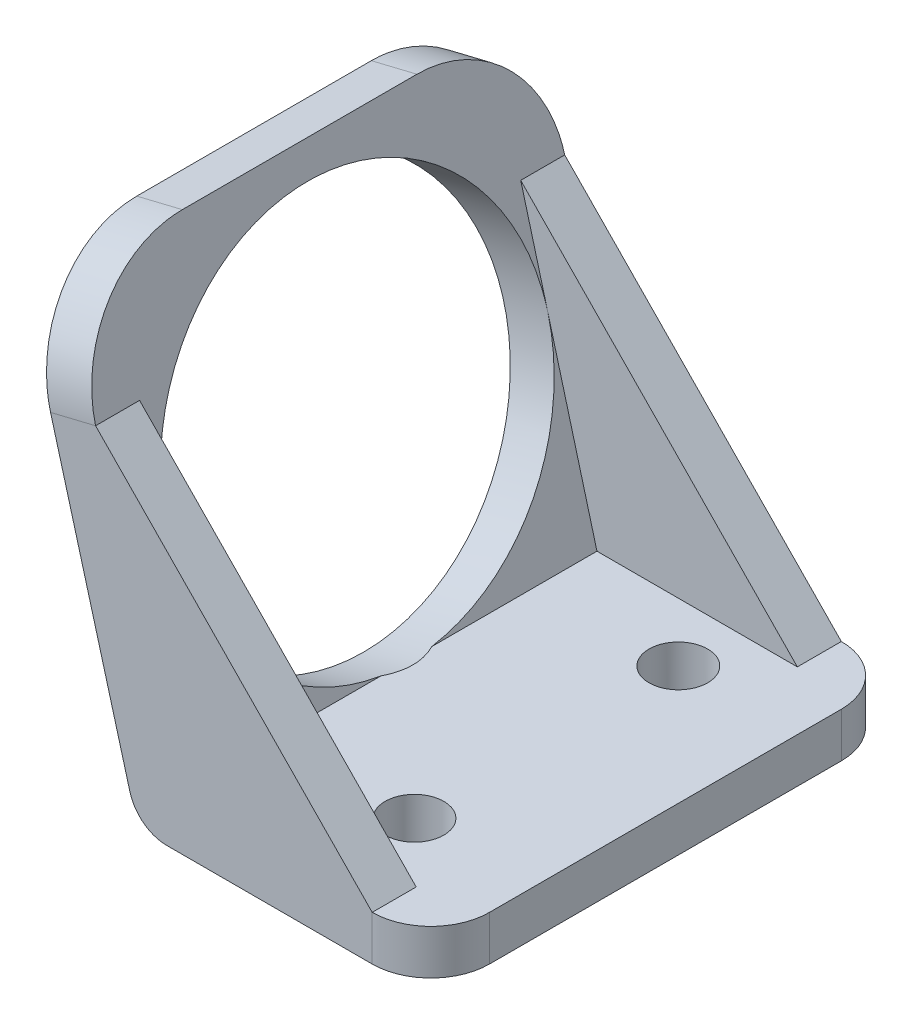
ISO-10303-21;
HEADER;
FILE_DESCRIPTION(('STEP AP214'),'2;1');
FILE_NAME('part.step','',(''),(''),'','','');
FILE_SCHEMA(('AUTOMOTIVE_DESIGN { 1 0 10303 214 1 1 1 1 }'));
ENDSEC;
DATA;
#1=APPLICATION_CONTEXT('core data for automotive mechanical design processes');
#2=APPLICATION_PROTOCOL_DEFINITION('international standard','automotive_design',2000,#1);
#3=PRODUCT_CONTEXT('',#1,'mechanical');
#4=PRODUCT('Part','Part','',(#3));
#5=PRODUCT_RELATED_PRODUCT_CATEGORY('part','',(#4));
#6=PRODUCT_DEFINITION_FORMATION('','',#4);
#7=PRODUCT_DEFINITION_CONTEXT('part definition',#1,'design');
#8=PRODUCT_DEFINITION('design','',#6,#7);
#9=PRODUCT_DEFINITION_SHAPE('','',#8);
#10=(LENGTH_UNIT() NAMED_UNIT(*) SI_UNIT(.MILLI.,.METRE.));
#11=(NAMED_UNIT(*) PLANE_ANGLE_UNIT() SI_UNIT($,.RADIAN.));
#12=(NAMED_UNIT(*) SI_UNIT($,.STERADIAN.) SOLID_ANGLE_UNIT());
#13=UNCERTAINTY_MEASURE_WITH_UNIT(LENGTH_MEASURE(1.E-05),#10,'distance_accuracy_value','');
#14=(GEOMETRIC_REPRESENTATION_CONTEXT(3) GLOBAL_UNCERTAINTY_ASSIGNED_CONTEXT((#13)) GLOBAL_UNIT_ASSIGNED_CONTEXT((#10,
#11,#12)) REPRESENTATION_CONTEXT('',''));
#15=CARTESIAN_POINT('',(0.,0.,0.));
#16=DIRECTION('',(0.,0.,1.));
#17=DIRECTION('',(1.,0.,0.));
#18=AXIS2_PLACEMENT_3D('',#15,#16,#17);
#19=CARTESIAN_POINT('',(-9.9792191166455,15.0455270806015,16.));
#20=DIRECTION('',(-0.965598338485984,-0.260038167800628,0.));
#21=DIRECTION('',(0.260038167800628,-0.965598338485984,0.));
#22=AXIS2_PLACEMENT_3D('',#19,#20,#21);
#23=PLANE('',#22);
#24=DIRECTION('',(-0.260038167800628,0.965598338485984,0.));
#25=VECTOR('',#24,1.);
#26=CARTESIAN_POINT('',(-9.9792191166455,15.0455270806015,14.5));
#27=LINE('',#26,#25);
#28=CARTESIAN_POINT('',(-6.3386847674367,1.52715034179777,14.5));
#29=VERTEX_POINT('',#28);
#30=CARTESIAN_POINT('',(-8.0138583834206,7.74756357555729,14.5));
#31=VERTEX_POINT('',#30);
#32=EDGE_CURVE('E323',#29,#31,#27,.T.);
#33=ORIENTED_EDGE('',*,*,#32,.F.);
#34=DIRECTION('',(0.,0.,-1.));
#35=VECTOR('',#34,1.);
#36=CARTESIAN_POINT('',(-6.3386847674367,1.52715034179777,16.));
#37=LINE('',#36,#35);
#38=CARTESIAN_POINT('',(-6.3386847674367,1.52715034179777,8.86678700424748));
#39=VERTEX_POINT('',#38);
#40=EDGE_CURVE('E230',#29,#39,#37,.T.);
#41=ORIENTED_EDGE('',*,*,#40,.T.);
#42=CARTESIAN_POINT('',(-8.0138583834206,7.74756357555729,8.));
#43=DIRECTION('',(-0.965598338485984,-0.260038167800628,0.));
#44=DIRECTION('',(0.260038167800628,-0.965598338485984,0.));
#45=AXIS2_PLACEMENT_3D('',#42,#43,#44);
#46=ELLIPSE('',#45,6.50008357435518,6.5);
#47=EDGE_CURVE('E239',#39,#31,#46,.T.);
#48=ORIENTED_EDGE('',*,*,#47,.T.);
#49=EDGE_LOOP('',(#33,#41,#48));
#50=FACE_BOUND('',#49,.T.);
#51=ADVANCED_FACE('F37',(#50),#23,.F.);
#52=DIRECTION('',(0.260038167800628,-0.965598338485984,0.));
#53=VECTOR('',#52,1.);
#54=CARTESIAN_POINT('',(-9.9792191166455,15.0455270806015,1.5));
#55=LINE('',#54,#53);
#56=CARTESIAN_POINT('',(-8.0138583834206,7.74756357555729,1.5));
#57=VERTEX_POINT('',#56);
#58=CARTESIAN_POINT('',(-6.3386847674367,1.52715034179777,1.5));
#59=VERTEX_POINT('',#58);
#60=EDGE_CURVE('E291',#57,#59,#55,.T.);
#61=ORIENTED_EDGE('',*,*,#60,.F.);
#62=CARTESIAN_POINT('',(-6.3386847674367,1.52715034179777,7.13321299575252));
#63=VERTEX_POINT('',#62);
#64=EDGE_CURVE('E238',#57,#63,#46,.T.);
#65=ORIENTED_EDGE('',*,*,#64,.T.);
#66=EDGE_CURVE('E201',#63,#59,#37,.T.);
#67=ORIENTED_EDGE('',*,*,#66,.T.);
#68=EDGE_LOOP('',(#61,#65,#67));
#69=FACE_BOUND('',#68,.T.);
#70=ADVANCED_FACE('F313',(#69),#23,.F.);
#71=CARTESIAN_POINT('',(-7.50402425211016,0.,16.));
#72=DIRECTION('',(0.964267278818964,0.264931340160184,0.));
#73=DIRECTION('',(-0.264931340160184,0.964267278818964,0.));
#74=AXIS2_PLACEMENT_3D('',#71,#72,#73);
#75=PLANE('',#74);
#76=CARTESIAN_POINT('',(-10.4738491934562,10.8092346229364,12.));
#77=DIRECTION('',(0.964267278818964,0.264931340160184,0.));
#78=DIRECTION('',(0.264931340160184,-0.964267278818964,0.));
#79=AXIS2_PLACEMENT_3D('',#76,#77,#78);
#80=ELLIPSE('',#79,4.00179521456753,4.);
#81=CARTESIAN_POINT('',(-10.4738491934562,10.8092346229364,16.));
#82=VERTEX_POINT('',#81);
#83=CARTESIAN_POINT('',(-11.5340501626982,14.6680348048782,12.));
#84=VERTEX_POINT('',#83);
#85=EDGE_CURVE('E176',#82,#84,#80,.F.);
#86=ORIENTED_EDGE('',*,*,#85,.T.);
#87=DIRECTION('',(0.,0.,-1.));
#88=VECTOR('',#87,1.);
#89=CARTESIAN_POINT('',(-11.5340501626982,14.6680348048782,16.));
#90=LINE('',#89,#88);
#91=CARTESIAN_POINT('',(-11.5340501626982,14.6680348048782,4.));
#92=VERTEX_POINT('',#91);
#93=EDGE_CURVE('E202',#84,#92,#90,.T.);
#94=ORIENTED_EDGE('',*,*,#93,.T.);
#95=CARTESIAN_POINT('',(-10.4738491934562,10.8092346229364,4.));
#96=DIRECTION('',(0.964267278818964,0.264931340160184,0.));
#97=DIRECTION('',(-0.264931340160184,0.964267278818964,0.));
#98=AXIS2_PLACEMENT_3D('',#95,#96,#97);
#99=ELLIPSE('',#98,4.00179521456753,4.);
#100=CARTESIAN_POINT('',(-10.4738491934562,10.8092346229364,0.));
#101=VERTEX_POINT('',#100);
#102=EDGE_CURVE('E177',#92,#101,#99,.F.);
#103=ORIENTED_EDGE('',*,*,#102,.T.);
#104=DIRECTION('',(0.264931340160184,-0.964267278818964,0.));
#105=VECTOR('',#104,1.);
#106=CARTESIAN_POINT('',(-7.50402425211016,0.,0.));
#107=LINE('',#106,#105);
#108=CARTESIAN_POINT('',(-7.76657131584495,0.955589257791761,0.));
#109=VERTEX_POINT('',#108);
#110=EDGE_CURVE('E208',#101,#109,#107,.T.);
#111=ORIENTED_EDGE('',*,*,#110,.T.);
#112=DIRECTION('',(0.,0.,-1.));
#113=VECTOR('',#112,1.);
#114=CARTESIAN_POINT('',(-7.76657131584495,0.955589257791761,16.));
#115=LINE('',#114,#113);
#116=CARTESIAN_POINT('',(-7.76657131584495,0.955589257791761,16.));
#117=VERTEX_POINT('',#116);
#118=EDGE_CURVE('E181',#109,#117,#115,.F.);
#119=ORIENTED_EDGE('',*,*,#118,.T.);
#120=DIRECTION('',(0.264931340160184,-0.964267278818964,0.));
#121=VECTOR('',#120,1.);
#122=CARTESIAN_POINT('',(-7.50402425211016,0.,16.));
#123=LINE('',#122,#121);
#124=EDGE_CURVE('E220',#82,#117,#123,.T.);
#125=ORIENTED_EDGE('',*,*,#124,.F.);
#126=EDGE_LOOP('',(#86,#94,#103,#111,#119,#125));
#127=FACE_BOUND('',#126,.T.);
#128=CARTESIAN_POINT('',(-9.51903720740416,7.33401740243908,8.));
#129=DIRECTION('',(-0.964267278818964,-0.264931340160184,0.));
#130=DIRECTION('',(0.264931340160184,-0.964267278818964,0.));
#131=AXIS2_PLACEMENT_3D('',#128,#129,#130);
#132=CIRCLE('',#131,6.5);
#133=CARTESIAN_POINT('',(-7.79698349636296,1.06628009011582,8.));
#134=VERTEX_POINT('',#133);
#135=EDGE_CURVE('E223',#134,#134,#132,.T.);
#136=ORIENTED_EDGE('',*,*,#135,.F.);
#137=EDGE_LOOP('',(#136));
#138=FACE_BOUND('',#137,.T.);
#139=ADVANCED_FACE('F206',(#127,#138),#75,.F.);
#140=CARTESIAN_POINT('',(-7.50402425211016,0.,16.));
#141=DIRECTION('',(0.,1.,0.));
#142=DIRECTION('',(0.,0.,1.));
#143=AXIS2_PLACEMENT_3D('',#140,#141,#142);
#144=PLANE('',#143);
#145=CARTESIAN_POINT('',(-1.56291912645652,0.,3.49999999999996));
#146=DIRECTION('',(0.,1.,0.));
#147=DIRECTION('',(0.,0.,1.));
#148=AXIS2_PLACEMENT_3D('',#145,#146,#147);
#149=CIRCLE('',#148,1.);
#150=CARTESIAN_POINT('',(-1.56291912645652,0.,4.49999999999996));
#151=VERTEX_POINT('',#150);
#152=EDGE_CURVE('E335',#151,#151,#149,.T.);
#153=ORIENTED_EDGE('',*,*,#152,.T.);
#154=EDGE_LOOP('',(#153));
#155=FACE_BOUND('',#154,.T.);
#156=CARTESIAN_POINT('',(-1.56291912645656,0.,12.5));
#157=DIRECTION('',(0.,1.,0.));
#158=DIRECTION('',(0.,0.,1.));
#159=AXIS2_PLACEMENT_3D('',#156,#157,#158);
#160=CIRCLE('',#159,1.);
#161=CARTESIAN_POINT('',(-1.56291912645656,0.,13.5));
#162=VERTEX_POINT('',#161);
#163=EDGE_CURVE('E328',#162,#162,#160,.T.);
#164=ORIENTED_EDGE('',*,*,#163,.T.);
#165=EDGE_LOOP('',(#164));
#166=FACE_BOUND('',#165,.T.);
#167=CARTESIAN_POINT('',(0.495975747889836,0.,14.));
#168=DIRECTION('',(0.,1.,0.));
#169=DIRECTION('',(0.,0.,1.));
#170=AXIS2_PLACEMENT_3D('',#167,#168,#169);
#171=CIRCLE('',#170,2.);
#172=CARTESIAN_POINT('',(2.49597574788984,0.,14.));
#173=VERTEX_POINT('',#172);
#174=CARTESIAN_POINT('',(0.495975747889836,0.,16.));
#175=VERTEX_POINT('',#174);
#176=EDGE_CURVE('E255',#173,#175,#171,.F.);
#177=ORIENTED_EDGE('',*,*,#176,.T.);
#178=DIRECTION('',(1.,0.,0.));
#179=VECTOR('',#178,1.);
#180=CARTESIAN_POINT('',(-7.50402425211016,0.,16.));
#181=LINE('',#180,#179);
#182=CARTESIAN_POINT('',(-6.51302385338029,0.,16.));
#183=VERTEX_POINT('',#182);
#184=EDGE_CURVE('E226',#183,#175,#181,.T.);
#185=ORIENTED_EDGE('',*,*,#184,.F.);
#186=DIRECTION('',(0.,0.,-1.));
#187=VECTOR('',#186,1.);
#188=CARTESIAN_POINT('',(-6.51302385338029,0.,16.));
#189=LINE('',#188,#187);
#190=CARTESIAN_POINT('',(-6.51302385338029,0.,0.));
#191=VERTEX_POINT('',#190);
#192=EDGE_CURVE('E260',#183,#191,#189,.T.);
#193=ORIENTED_EDGE('',*,*,#192,.T.);
#194=DIRECTION('',(1.,0.,0.));
#195=VECTOR('',#194,1.);
#196=CARTESIAN_POINT('',(-7.50402425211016,0.,0.));
#197=LINE('',#196,#195);
#198=CARTESIAN_POINT('',(0.495975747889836,0.,0.));
#199=VERTEX_POINT('',#198);
#200=EDGE_CURVE('E217',#191,#199,#197,.T.);
#201=ORIENTED_EDGE('',*,*,#200,.T.);
#202=CARTESIAN_POINT('',(0.495975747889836,0.,2.));
#203=DIRECTION('',(0.,1.,0.));
#204=DIRECTION('',(0.,0.,1.));
#205=AXIS2_PLACEMENT_3D('',#202,#203,#204);
#206=CIRCLE('',#205,2.);
#207=CARTESIAN_POINT('',(2.49597574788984,0.,2.));
#208=VERTEX_POINT('',#207);
#209=EDGE_CURVE('E257',#199,#208,#206,.F.);
#210=ORIENTED_EDGE('',*,*,#209,.T.);
#211=DIRECTION('',(0.,0.,-1.));
#212=VECTOR('',#211,1.);
#213=CARTESIAN_POINT('',(2.49597574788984,0.,16.));
#214=LINE('',#213,#212);
#215=EDGE_CURVE('E235',#173,#208,#214,.T.);
#216=ORIENTED_EDGE('',*,*,#215,.F.);
#217=EDGE_LOOP('',(#177,#185,#193,#201,#210,#216));
#218=FACE_BOUND('',#217,.T.);
#219=ADVANCED_FACE('F268',(#155,#166,#218),#144,.F.);
#220=CARTESIAN_POINT('',(2.49597574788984,0.,16.));
#221=DIRECTION('',(-1.,0.,0.));
#222=DIRECTION('',(0.,-1.,0.));
#223=AXIS2_PLACEMENT_3D('',#220,#221,#222);
#224=PLANE('',#223);
#225=ORIENTED_EDGE('',*,*,#215,.T.);
#226=DIRECTION('',(0.,1.,0.));
#227=VECTOR('',#226,1.);
#228=CARTESIAN_POINT('',(2.49597574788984,0.,2.));
#229=LINE('',#228,#227);
#230=CARTESIAN_POINT('',(2.49597574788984,1.52715034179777,2.));
#231=VERTEX_POINT('',#230);
#232=EDGE_CURVE('E245',#208,#231,#229,.T.);
#233=ORIENTED_EDGE('',*,*,#232,.T.);
#234=DIRECTION('',(0.,0.,-1.));
#235=VECTOR('',#234,1.);
#236=CARTESIAN_POINT('',(2.49597574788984,1.52715034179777,16.));
#237=LINE('',#236,#235);
#238=CARTESIAN_POINT('',(2.49597574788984,1.52715034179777,14.));
#239=VERTEX_POINT('',#238);
#240=EDGE_CURVE('E232',#239,#231,#237,.T.);
#241=ORIENTED_EDGE('',*,*,#240,.F.);
#242=DIRECTION('',(0.,1.,0.));
#243=VECTOR('',#242,1.);
#244=CARTESIAN_POINT('',(2.49597574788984,0.,14.));
#245=LINE('',#244,#243);
#246=EDGE_CURVE('E242',#239,#173,#245,.F.);
#247=ORIENTED_EDGE('',*,*,#246,.T.);
#248=EDGE_LOOP('',(#225,#233,#241,#247));
#249=FACE_BOUND('',#248,.T.);
#250=ADVANCED_FACE('F279',(#249),#224,.F.);
#251=CARTESIAN_POINT('',(-6.3386847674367,1.52715034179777,16.));
#252=DIRECTION('',(0.,-1.,0.));
#253=DIRECTION('',(0.,0.,-1.));
#254=AXIS2_PLACEMENT_3D('',#251,#252,#253);
#255=PLANE('',#254);
#256=CARTESIAN_POINT('',(-1.56291912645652,1.52715034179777,3.49999999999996));
#257=DIRECTION('',(0.,1.,0.));
#258=DIRECTION('',(0.,0.,-1.));
#259=AXIS2_PLACEMENT_3D('',#256,#257,#258);
#260=CIRCLE('',#259,1.);
#261=CARTESIAN_POINT('',(-1.56291912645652,1.52715034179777,2.49999999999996));
#262=VERTEX_POINT('',#261);
#263=EDGE_CURVE('E338',#262,#262,#260,.T.);
#264=ORIENTED_EDGE('',*,*,#263,.F.);
#265=EDGE_LOOP('',(#264));
#266=FACE_BOUND('',#265,.T.);
#267=CARTESIAN_POINT('',(-1.56291912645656,1.52715034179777,12.5));
#268=DIRECTION('',(0.,1.,0.));
#269=DIRECTION('',(0.,0.,1.));
#270=AXIS2_PLACEMENT_3D('',#267,#268,#269);
#271=CIRCLE('',#270,1.);
#272=CARTESIAN_POINT('',(-1.56291912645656,1.52715034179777,13.5));
#273=VERTEX_POINT('',#272);
#274=EDGE_CURVE('E332',#273,#273,#271,.T.);
#275=ORIENTED_EDGE('',*,*,#274,.F.);
#276=EDGE_LOOP('',(#275));
#277=FACE_BOUND('',#276,.T.);
#278=DIRECTION('',(-1.,0.,0.));
#279=VECTOR('',#278,1.);
#280=CARTESIAN_POINT('',(-6.3386847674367,1.52715034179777,14.5));
#281=LINE('',#280,#279);
#282=CARTESIAN_POINT('',(0.495975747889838,1.52715034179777,14.5));
#283=VERTEX_POINT('',#282);
#284=EDGE_CURVE('E295',#283,#29,#281,.T.);
#285=ORIENTED_EDGE('',*,*,#284,.F.);
#286=DIRECTION('',(0.,0.,-1.));
#287=VECTOR('',#286,1.);
#288=CARTESIAN_POINT('',(0.495975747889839,1.52715034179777,16.));
#289=LINE('',#288,#287);
#290=CARTESIAN_POINT('',(0.495975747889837,1.52715034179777,16.));
#291=VERTEX_POINT('',#290);
#292=EDGE_CURVE('E153',#283,#291,#289,.F.);
#293=ORIENTED_EDGE('',*,*,#292,.T.);
#294=CARTESIAN_POINT('',(0.495975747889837,1.52715034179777,14.));
#295=DIRECTION('',(0.,-1.,0.));
#296=DIRECTION('',(0.,0.,-1.));
#297=AXIS2_PLACEMENT_3D('',#294,#295,#296);
#298=CIRCLE('',#297,2.);
#299=EDGE_CURVE('E248',#291,#239,#298,.F.);
#300=ORIENTED_EDGE('',*,*,#299,.T.);
#301=ORIENTED_EDGE('',*,*,#240,.T.);
#302=CARTESIAN_POINT('',(0.495975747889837,1.52715034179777,2.));
#303=DIRECTION('',(0.,-1.,0.));
#304=DIRECTION('',(0.,0.,-1.));
#305=AXIS2_PLACEMENT_3D('',#302,#303,#304);
#306=CIRCLE('',#305,2.);
#307=CARTESIAN_POINT('',(0.495975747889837,1.52715034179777,0.));
#308=VERTEX_POINT('',#307);
#309=EDGE_CURVE('E250',#231,#308,#306,.F.);
#310=ORIENTED_EDGE('',*,*,#309,.T.);
#311=DIRECTION('',(0.,0.,1.));
#312=VECTOR('',#311,1.);
#313=CARTESIAN_POINT('',(0.495975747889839,1.52715034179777,16.));
#314=LINE('',#313,#312);
#315=CARTESIAN_POINT('',(0.495975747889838,1.52715034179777,1.5));
#316=VERTEX_POINT('',#315);
#317=EDGE_CURVE('E52',#308,#316,#314,.T.);
#318=ORIENTED_EDGE('',*,*,#317,.T.);
#319=DIRECTION('',(1.,0.,0.));
#320=VECTOR('',#319,1.);
#321=CARTESIAN_POINT('',(-6.3386847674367,1.52715034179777,1.5));
#322=LINE('',#321,#320);
#323=EDGE_CURVE('E302',#59,#316,#322,.T.);
#324=ORIENTED_EDGE('',*,*,#323,.F.);
#325=ORIENTED_EDGE('',*,*,#66,.F.);
#326=CARTESIAN_POINT('',(-30.6542184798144,1.52715034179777,8.));
#327=DIRECTION('',(0.,-1.,0.));
#328=DIRECTION('',(-1.,0.,0.));
#329=AXIS2_PLACEMENT_3D('',#326,#327,#328);
#330=ELLIPSE('',#329,24.5346586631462,6.5);
#331=EDGE_CURVE('E218',#63,#39,#330,.T.);
#332=ORIENTED_EDGE('',*,*,#331,.T.);
#333=ORIENTED_EDGE('',*,*,#40,.F.);
#334=EDGE_LOOP('',(#285,#293,#300,#301,#310,#318,#324,#325,#332,#333));
#335=FACE_BOUND('',#334,.T.);
#336=ADVANCED_FACE('F277',(#266,#277,#335),#255,.F.);
#337=CARTESIAN_POINT('',(-8.93874433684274,11.1819376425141,12.));
#338=DIRECTION('',(-0.965598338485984,-0.260038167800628,0.));
#339=DIRECTION('',(0.260038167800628,-0.965598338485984,0.));
#340=AXIS2_PLACEMENT_3D('',#337,#338,#339);
#341=ELLIPSE('',#340,4.0012386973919,4.);
#342=CARTESIAN_POINT('',(-9.9792191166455,15.0455270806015,12.));
#343=VERTEX_POINT('',#342);
#344=CARTESIAN_POINT('',(-8.93874433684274,11.1819376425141,16.));
#345=VERTEX_POINT('',#344);
#346=EDGE_CURVE('E45',#343,#345,#341,.F.);
#347=ORIENTED_EDGE('',*,*,#346,.T.);
#348=DIRECTION('',(0.,0.,1.));
#349=VECTOR('',#348,1.);
#350=CARTESIAN_POINT('',(-8.93874433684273,11.1819376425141,16.));
#351=LINE('',#350,#349);
#352=CARTESIAN_POINT('',(-8.93874433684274,11.1819376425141,14.5));
#353=VERTEX_POINT('',#352);
#354=EDGE_CURVE('E144',#345,#353,#351,.F.);
#355=ORIENTED_EDGE('',*,*,#354,.T.);
#356=EDGE_CURVE('E325',#31,#353,#27,.T.);
#357=ORIENTED_EDGE('',*,*,#356,.F.);
#358=EDGE_CURVE('E243',#31,#57,#46,.T.);
#359=ORIENTED_EDGE('',*,*,#358,.T.);
#360=CARTESIAN_POINT('',(-8.93874433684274,11.1819376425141,1.5));
#361=VERTEX_POINT('',#360);
#362=EDGE_CURVE('E60',#361,#57,#55,.T.);
#363=ORIENTED_EDGE('',*,*,#362,.F.);
#364=DIRECTION('',(0.,0.,-1.));
#365=VECTOR('',#364,1.);
#366=CARTESIAN_POINT('',(-8.93874433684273,11.1819376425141,16.));
#367=LINE('',#366,#365);
#368=CARTESIAN_POINT('',(-8.93874433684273,11.1819376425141,0.));
#369=VERTEX_POINT('',#368);
#370=EDGE_CURVE('E192',#361,#369,#367,.T.);
#371=ORIENTED_EDGE('',*,*,#370,.T.);
#372=CARTESIAN_POINT('',(-8.93874433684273,11.1819376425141,4.));
#373=DIRECTION('',(-0.965598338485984,-0.260038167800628,0.));
#374=DIRECTION('',(-0.260038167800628,0.965598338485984,0.));
#375=AXIS2_PLACEMENT_3D('',#372,#373,#374);
#376=ELLIPSE('',#375,4.0012386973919,4.);
#377=CARTESIAN_POINT('',(-9.9792191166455,15.0455270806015,4.));
#378=VERTEX_POINT('',#377);
#379=EDGE_CURVE('E174',#369,#378,#376,.F.);
#380=ORIENTED_EDGE('',*,*,#379,.T.);
#381=DIRECTION('',(0.,0.,-1.));
#382=VECTOR('',#381,1.);
#383=CARTESIAN_POINT('',(-9.9792191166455,15.0455270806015,16.));
#384=LINE('',#383,#382);
#385=EDGE_CURVE('E171',#343,#378,#384,.T.);
#386=ORIENTED_EDGE('',*,*,#385,.F.);
#387=EDGE_LOOP('',(#347,#355,#357,#359,#363,#371,#380,#386));
#388=FACE_BOUND('',#387,.T.);
#389=ADVANCED_FACE('F169',(#388),#23,.F.);
#390=CARTESIAN_POINT('',(-9.9792191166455,15.0455270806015,16.));
#391=DIRECTION('',(0.23593267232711,-0.971769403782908,0.));
#392=DIRECTION('',(0.971769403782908,0.23593267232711,0.));
#393=AXIS2_PLACEMENT_3D('',#390,#391,#392);
#394=PLANE('',#393);
#395=ORIENTED_EDGE('',*,*,#93,.F.);
#396=DIRECTION('',(-0.971769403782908,-0.23593267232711,0.));
#397=VECTOR('',#396,1.);
#398=CARTESIAN_POINT('',(-9.9792191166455,15.0455270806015,12.));
#399=LINE('',#398,#397);
#400=EDGE_CURVE('E189',#84,#343,#399,.F.);
#401=ORIENTED_EDGE('',*,*,#400,.T.);
#402=ORIENTED_EDGE('',*,*,#385,.T.);
#403=DIRECTION('',(-0.971769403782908,-0.23593267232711,0.));
#404=VECTOR('',#403,1.);
#405=CARTESIAN_POINT('',(-9.9792191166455,15.0455270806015,4.));
#406=LINE('',#405,#404);
#407=EDGE_CURVE('E186',#378,#92,#406,.T.);
#408=ORIENTED_EDGE('',*,*,#407,.T.);
#409=EDGE_LOOP('',(#395,#401,#402,#408));
#410=FACE_BOUND('',#409,.T.);
#411=ADVANCED_FACE('F199',(#410),#394,.F.);
#412=CARTESIAN_POINT('',(0.,0.,16.));
#413=DIRECTION('',(0.,0.,1.));
#414=DIRECTION('',(1.,0.,0.));
#415=AXIS2_PLACEMENT_3D('',#412,#413,#414);
#416=PLANE('',#415);
#417=DIRECTION('',(0.698908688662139,-0.715210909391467,0.));
#418=VECTOR('',#417,1.);
#419=CARTESIAN_POINT('',(-8.93874433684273,11.1819376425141,16.));
#420=LINE('',#419,#418);
#421=EDGE_CURVE('E147',#345,#291,#420,.T.);
#422=ORIENTED_EDGE('',*,*,#421,.F.);
#423=DIRECTION('',(-0.971769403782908,-0.23593267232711,0.));
#424=VECTOR('',#423,1.);
#425=CARTESIAN_POINT('',(-10.5903194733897,10.7809571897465,16.));
#426=LINE('',#425,#424);
#427=EDGE_CURVE('E161',#345,#82,#426,.T.);
#428=ORIENTED_EDGE('',*,*,#427,.T.);
#429=ORIENTED_EDGE('',*,*,#124,.T.);
#430=CARTESIAN_POINT('',(-6.51302385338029,1.3,16.));
#431=DIRECTION('',(0.,0.,1.));
#432=DIRECTION('',(1.,0.,0.));
#433=AXIS2_PLACEMENT_3D('',#430,#431,#432);
#434=CIRCLE('',#433,1.3);
#435=EDGE_CURVE('E178',#117,#183,#434,.T.);
#436=ORIENTED_EDGE('',*,*,#435,.T.);
#437=ORIENTED_EDGE('',*,*,#184,.T.);
#438=DIRECTION('',(0.,1.,0.));
#439=VECTOR('',#438,1.);
#440=CARTESIAN_POINT('',(0.495975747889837,1.52715034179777,16.));
#441=LINE('',#440,#439);
#442=EDGE_CURVE('E165',#175,#291,#441,.T.);
#443=ORIENTED_EDGE('',*,*,#442,.T.);
#444=EDGE_LOOP('',(#422,#428,#429,#436,#437,#443));
#445=FACE_BOUND('',#444,.T.);
#446=ADVANCED_FACE('F158',(#445),#416,.T.);
#447=CARTESIAN_POINT('',(0.,0.,0.));
#448=DIRECTION('',(0.,0.,1.));
#449=DIRECTION('',(1.,0.,0.));
#450=AXIS2_PLACEMENT_3D('',#447,#448,#449);
#451=PLANE('',#450);
#452=DIRECTION('',(-0.971769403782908,-0.23593267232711,0.));
#453=VECTOR('',#452,1.);
#454=CARTESIAN_POINT('',(-3.06127519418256,12.6089088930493,0.));
#455=LINE('',#454,#453);
#456=EDGE_CURVE('E11',#101,#369,#455,.F.);
#457=ORIENTED_EDGE('',*,*,#456,.T.);
#458=DIRECTION('',(0.698908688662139,-0.715210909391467,0.));
#459=VECTOR('',#458,1.);
#460=CARTESIAN_POINT('',(-8.93874433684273,11.1819376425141,0.));
#461=LINE('',#460,#459);
#462=EDGE_CURVE('E288',#369,#308,#461,.T.);
#463=ORIENTED_EDGE('',*,*,#462,.T.);
#464=DIRECTION('',(0.,1.,0.));
#465=VECTOR('',#464,1.);
#466=CARTESIAN_POINT('',(0.495975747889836,0.,0.));
#467=LINE('',#466,#465);
#468=EDGE_CURVE('E252',#308,#199,#467,.F.);
#469=ORIENTED_EDGE('',*,*,#468,.T.);
#470=ORIENTED_EDGE('',*,*,#200,.F.);
#471=CARTESIAN_POINT('',(-6.51302385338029,1.3,0.));
#472=DIRECTION('',(0.,0.,1.));
#473=DIRECTION('',(1.,0.,0.));
#474=AXIS2_PLACEMENT_3D('',#471,#472,#473);
#475=CIRCLE('',#474,1.3);
#476=EDGE_CURVE('E215',#191,#109,#475,.F.);
#477=ORIENTED_EDGE('',*,*,#476,.T.);
#478=ORIENTED_EDGE('',*,*,#110,.F.);
#479=EDGE_LOOP('',(#457,#463,#469,#470,#477,#478));
#480=FACE_BOUND('',#479,.T.);
#481=ADVANCED_FACE('F211',(#480),#451,.F.);
#482=CARTESIAN_POINT('',(11.694842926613,13.1625068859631,8.));
#483=DIRECTION('',(-0.964267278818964,-0.264931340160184,0.));
#484=DIRECTION('',(0.264931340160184,-0.964267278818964,0.));
#485=AXIS2_PLACEMENT_3D('',#482,#483,#484);
#486=CYLINDRICAL_SURFACE('',#485,6.5);
#487=ORIENTED_EDGE('',*,*,#358,.F.);
#488=ORIENTED_EDGE('',*,*,#47,.F.);
#489=ORIENTED_EDGE('',*,*,#331,.F.);
#490=ORIENTED_EDGE('',*,*,#64,.F.);
#491=EDGE_LOOP('',(#487,#488,#489,#490));
#492=FACE_BOUND('',#491,.T.);
#493=ORIENTED_EDGE('',*,*,#135,.T.);
#494=EDGE_LOOP('',(#493));
#495=FACE_BOUND('',#494,.T.);
#496=ADVANCED_FACE('F319',(#492,#495),#486,.F.);
#497=CARTESIAN_POINT('',(0.495975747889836,0.,2.));
#498=DIRECTION('',(0.,1.,0.));
#499=DIRECTION('',(-1.,0.,0.));
#500=AXIS2_PLACEMENT_3D('',#497,#498,#499);
#501=CYLINDRICAL_SURFACE('',#500,2.);
#502=ORIENTED_EDGE('',*,*,#232,.F.);
#503=ORIENTED_EDGE('',*,*,#209,.F.);
#504=ORIENTED_EDGE('',*,*,#468,.F.);
#505=ORIENTED_EDGE('',*,*,#309,.F.);
#506=EDGE_LOOP('',(#502,#503,#504,#505));
#507=FACE_BOUND('',#506,.T.);
#508=ADVANCED_FACE('F283',(#507),#501,.T.);
#509=CARTESIAN_POINT('',(0.495975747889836,0.,14.));
#510=DIRECTION('',(0.,-1.,0.));
#511=DIRECTION('',(1.,0.,0.));
#512=AXIS2_PLACEMENT_3D('',#509,#510,#511);
#513=CYLINDRICAL_SURFACE('',#512,2.);
#514=ORIENTED_EDGE('',*,*,#299,.F.);
#515=ORIENTED_EDGE('',*,*,#442,.F.);
#516=ORIENTED_EDGE('',*,*,#176,.F.);
#517=ORIENTED_EDGE('',*,*,#246,.F.);
#518=EDGE_LOOP('',(#514,#515,#516,#517));
#519=FACE_BOUND('',#518,.T.);
#520=ADVANCED_FACE('F273',(#519),#513,.T.);
#521=CARTESIAN_POINT('',(-6.51302385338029,1.3,16.));
#522=DIRECTION('',(0.,0.,-1.));
#523=DIRECTION('',(-1.,0.,0.));
#524=AXIS2_PLACEMENT_3D('',#521,#522,#523);
#525=CYLINDRICAL_SURFACE('',#524,1.3);
#526=ORIENTED_EDGE('',*,*,#435,.F.);
#527=ORIENTED_EDGE('',*,*,#118,.F.);
#528=ORIENTED_EDGE('',*,*,#476,.F.);
#529=ORIENTED_EDGE('',*,*,#192,.F.);
#530=EDGE_LOOP('',(#526,#527,#528,#529));
#531=FACE_BOUND('',#530,.T.);
#532=ADVANCED_FACE('F266',(#531),#525,.T.);
#533=CARTESIAN_POINT('',(-3.06127519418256,12.6089088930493,12.));
#534=DIRECTION('',(0.971769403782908,0.23593267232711,0.));
#535=DIRECTION('',(-0.23593267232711,0.971769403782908,0.));
#536=AXIS2_PLACEMENT_3D('',#533,#534,#535);
#537=CYLINDRICAL_SURFACE('',#536,4.);
#538=ORIENTED_EDGE('',*,*,#400,.F.);
#539=ORIENTED_EDGE('',*,*,#85,.F.);
#540=ORIENTED_EDGE('',*,*,#427,.F.);
#541=ORIENTED_EDGE('',*,*,#346,.F.);
#542=EDGE_LOOP('',(#538,#539,#540,#541));
#543=FACE_BOUND('',#542,.T.);
#544=ADVANCED_FACE('F175',(#543),#537,.T.);
#545=CARTESIAN_POINT('',(-9.03548842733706,11.1584494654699,4.));
#546=DIRECTION('',(-0.971769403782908,-0.23593267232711,0.));
#547=DIRECTION('',(0.23593267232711,-0.971769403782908,0.));
#548=AXIS2_PLACEMENT_3D('',#545,#546,#547);
#549=CYLINDRICAL_SURFACE('',#548,4.);
#550=ORIENTED_EDGE('',*,*,#379,.F.);
#551=ORIENTED_EDGE('',*,*,#456,.F.);
#552=ORIENTED_EDGE('',*,*,#102,.F.);
#553=ORIENTED_EDGE('',*,*,#407,.F.);
#554=EDGE_LOOP('',(#550,#551,#552,#553));
#555=FACE_BOUND('',#554,.T.);
#556=ADVANCED_FACE('F39',(#555),#549,.T.);
#557=CARTESIAN_POINT('',(-4.51903720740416,7.52276354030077,1.5));
#558=DIRECTION('',(0.,0.,-1.));
#559=DIRECTION('',(-1.,0.,0.));
#560=AXIS2_PLACEMENT_3D('',#557,#558,#559);
#561=PLANE('',#560);
#562=DIRECTION('',(0.698908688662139,-0.715210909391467,0.));
#563=VECTOR('',#562,1.);
#564=CARTESIAN_POINT('',(-8.93874433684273,11.1819376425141,1.5));
#565=LINE('',#564,#563);
#566=EDGE_CURVE('E290',#361,#316,#565,.T.);
#567=ORIENTED_EDGE('',*,*,#566,.F.);
#568=ORIENTED_EDGE('',*,*,#362,.T.);
#569=ORIENTED_EDGE('',*,*,#60,.T.);
#570=ORIENTED_EDGE('',*,*,#323,.T.);
#571=EDGE_LOOP('',(#567,#568,#569,#570));
#572=FACE_BOUND('',#571,.T.);
#573=ADVANCED_FACE('F308',(#572),#561,.F.);
#574=CARTESIAN_POINT('',(-8.93874433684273,11.1819376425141,0.));
#575=DIRECTION('',(0.715210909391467,0.698908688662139,0.));
#576=DIRECTION('',(0.698908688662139,-0.715210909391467,0.));
#577=AXIS2_PLACEMENT_3D('',#574,#575,#576);
#578=PLANE('',#577);
#579=ORIENTED_EDGE('',*,*,#317,.F.);
#580=ORIENTED_EDGE('',*,*,#462,.F.);
#581=ORIENTED_EDGE('',*,*,#370,.F.);
#582=ORIENTED_EDGE('',*,*,#566,.T.);
#583=EDGE_LOOP('',(#579,#580,#581,#582));
#584=FACE_BOUND('',#583,.T.);
#585=ADVANCED_FACE('F287',(#584),#578,.T.);
#586=CARTESIAN_POINT('',(-4.51903720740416,7.52276354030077,14.5));
#587=DIRECTION('',(0.,0.,1.));
#588=DIRECTION('',(1.,0.,0.));
#589=AXIS2_PLACEMENT_3D('',#586,#587,#588);
#590=PLANE('',#589);
#591=DIRECTION('',(0.698908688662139,-0.715210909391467,0.));
#592=VECTOR('',#591,1.);
#593=CARTESIAN_POINT('',(-8.93874433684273,11.1819376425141,14.5));
#594=LINE('',#593,#592);
#595=EDGE_CURVE('E150',#353,#283,#594,.T.);
#596=ORIENTED_EDGE('',*,*,#595,.T.);
#597=ORIENTED_EDGE('',*,*,#284,.T.);
#598=ORIENTED_EDGE('',*,*,#32,.T.);
#599=ORIENTED_EDGE('',*,*,#356,.T.);
#600=EDGE_LOOP('',(#596,#597,#598,#599));
#601=FACE_BOUND('',#600,.T.);
#602=ADVANCED_FACE('F386',(#601),#590,.F.);
#603=CARTESIAN_POINT('',(-8.93874433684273,11.1819376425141,16.));
#604=DIRECTION('',(-0.715210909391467,-0.698908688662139,0.));
#605=DIRECTION('',(0.698908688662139,-0.715210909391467,0.));
#606=AXIS2_PLACEMENT_3D('',#603,#604,#605);
#607=PLANE('',#606);
#608=ORIENTED_EDGE('',*,*,#292,.F.);
#609=ORIENTED_EDGE('',*,*,#595,.F.);
#610=ORIENTED_EDGE('',*,*,#354,.F.);
#611=ORIENTED_EDGE('',*,*,#421,.T.);
#612=EDGE_LOOP('',(#608,#609,#610,#611));
#613=FACE_BOUND('',#612,.T.);
#614=ADVANCED_FACE('F146',(#613),#607,.F.);
#615=CARTESIAN_POINT('',(-1.56291912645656,-8.47284965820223,12.5));
#616=DIRECTION('',(0.,1.,0.));
#617=DIRECTION('',(0.,0.,1.));
#618=AXIS2_PLACEMENT_3D('',#615,#616,#617);
#619=CYLINDRICAL_SURFACE('',#618,1.);
#620=ORIENTED_EDGE('',*,*,#274,.T.);
#621=EDGE_LOOP('',(#620));
#622=FACE_BOUND('',#621,.T.);
#623=ORIENTED_EDGE('',*,*,#163,.F.);
#624=EDGE_LOOP('',(#623));
#625=FACE_BOUND('',#624,.T.);
#626=ADVANCED_FACE('F350',(#622,#625),#619,.F.);
#627=CARTESIAN_POINT('',(-1.56291912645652,-8.47284965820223,3.49999999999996));
#628=DIRECTION('',(0.,1.,0.));
#629=DIRECTION('',(0.,0.,1.));
#630=AXIS2_PLACEMENT_3D('',#627,#628,#629);
#631=CYLINDRICAL_SURFACE('',#630,1.);
#632=ORIENTED_EDGE('',*,*,#263,.T.);
#633=EDGE_LOOP('',(#632));
#634=FACE_BOUND('',#633,.T.);
#635=ORIENTED_EDGE('',*,*,#152,.F.);
#636=EDGE_LOOP('',(#635));
#637=FACE_BOUND('',#636,.T.);
#638=ADVANCED_FACE('F342',(#634,#637),#631,.F.);
#639=CLOSED_SHELL('',(#51,#70,#139,#219,#250,#336,#389,#411,#446,#481,#496,#508,#520,#532,#544,
#556,#573,#585,#602,#614,#626,#638));
#640=MANIFOLD_SOLID_BREP('B2',#639);
#641=ADVANCED_BREP_SHAPE_REPRESENTATION('',(#18,#640),#14);
#642=SHAPE_DEFINITION_REPRESENTATION(#9,#641);
ENDSEC;
END-ISO-10303-21;
